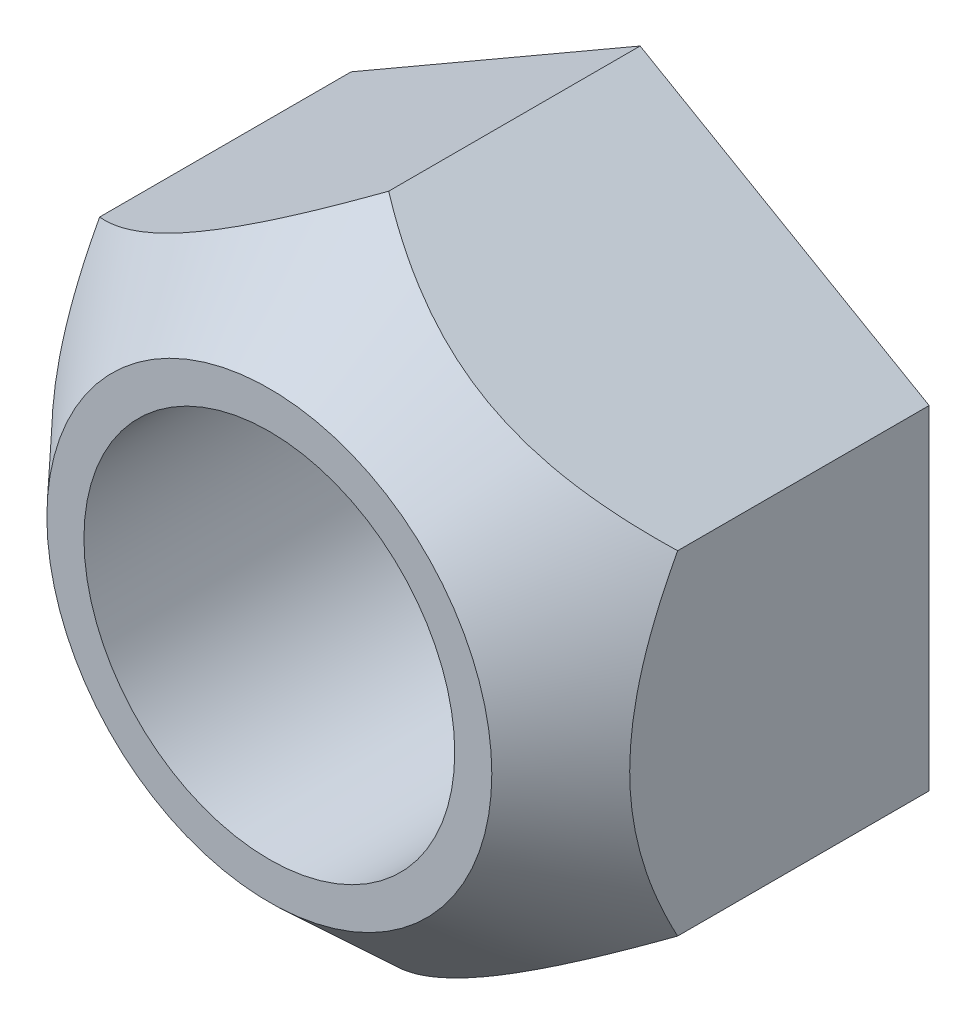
from build123d import *

# Parameters (mm, degrees)
EXTRUSION1_DEPTH        = 5
ESQUISSE2_R             = 2.5
ENL_V_MAT_EXTRU_1_DEPTH = 5
ESQUISSE3_R             = 8
ESQUISSE3_R_2           = 3
ENL_V_MAT_EXTRU_2_DEPTH = 5
ENL_V_MAT_EXTRU_2_TAPER = 43


with BuildPart() as part:
    # Esquisse1 → Extrusion1 (new body)
    with BuildSketch(Plane.XY):
        Polygon((0, -4.5), (3.897114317, -2.25), (3.897114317, 2.25), (0, 4.5), (-3.897114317, 2.25), (-3.897114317, -2.25), align=None)
    extrude(amount=-EXTRUSION1_DEPTH)

    # Esquisse2 → Enl_v. mat.-Extru.1 (cut)
    with BuildSketch(Plane.XY):
        Circle(ESQUISSE2_R)
    extrude(amount=-ENL_V_MAT_EXTRU_1_DEPTH, mode=Mode.SUBTRACT)

    # Esquisse3 → Enl_v. mat.-Extru.2 (cut)
    with BuildSketch(Plane.XY):
        Circle(ESQUISSE3_R)
        Circle(ESQUISSE3_R_2, mode=Mode.SUBTRACT)
    extrude(amount=-ENL_V_MAT_EXTRU_2_DEPTH, taper=ENL_V_MAT_EXTRU_2_TAPER, mode=Mode.SUBTRACT)


solid = part.part
